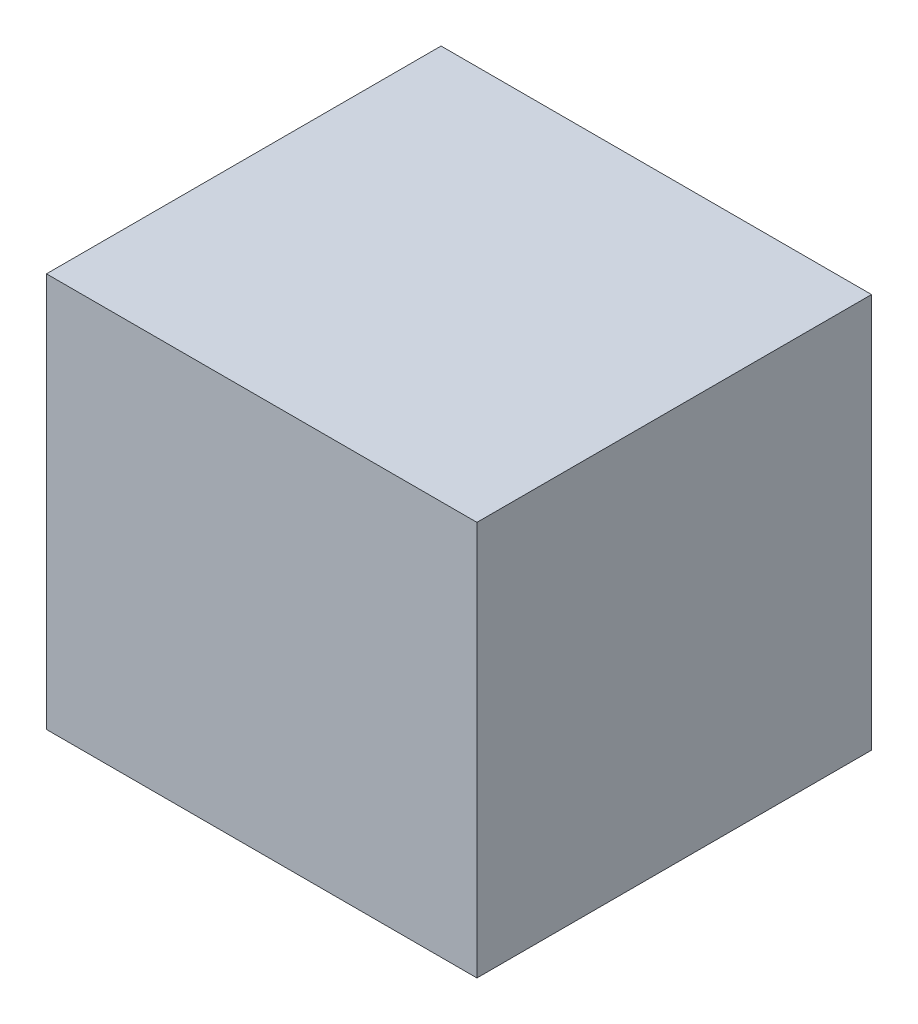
from build123d import *

# Parameters (mm, degrees)
SKETCH1_W           = 110
SKETCH1_H           = 110
BOSS_EXTRUDE1_DEPTH = 120


with BuildPart() as part:
    # Sketch1 → Boss-Extrude1 (new body)
    with BuildSketch(Plane(origin=(0, 0, 0), x_dir=(0, 0, -1), z_dir=(1, 0, 0))):
        with Locations((55, 55)):
            Rectangle(SKETCH1_W, SKETCH1_H)
    extrude(amount=BOSS_EXTRUDE1_DEPTH)


solid = part.part
